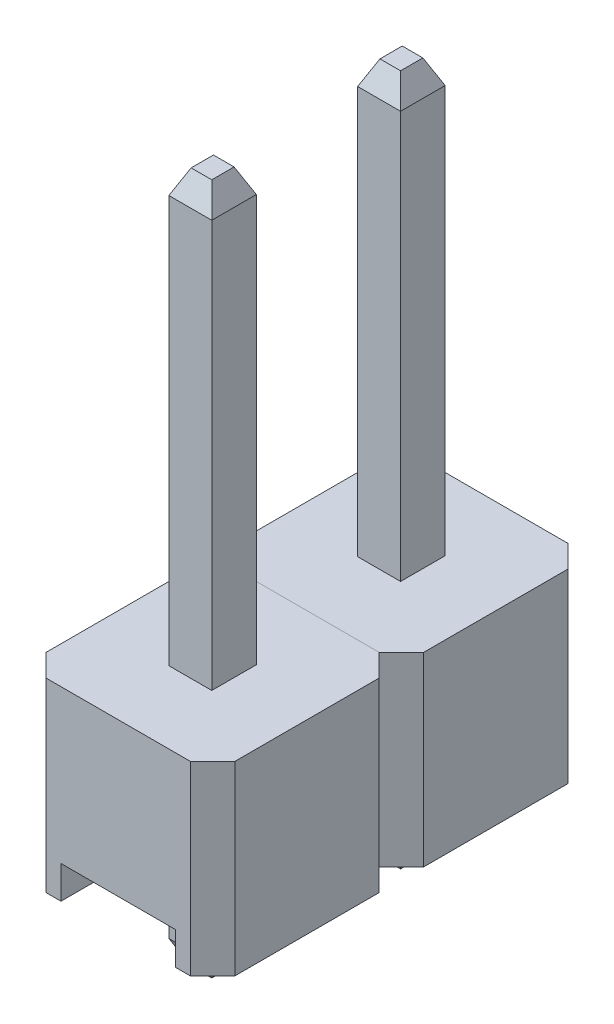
from build123d import *

# Parameters (mm, degrees)
CUERPO_PL_STICO_DEPTH = 2.5
CROQUIS2_W            = 1.54
CROQUIS2_H            = 2.54
RANURA_DEPTH          = 0.44
PIN_DEPTH             = 5.8
PIN_DEPTH_BACK        = 3.5
CROQUIS3_W            = 0.57750613
CROQUIS3_H            = 0.6
CHAFL_N1_SIZE         = 0.15
CHAFL_N1_SIZE2        = 0.321676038
CHAFL_N2_SIZE         = 0.15
CHAFL_N2_SIZE2        = 0.321676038
MATRIZ_COUNT          = 2
MATRIZ_PITCH          = 2.54


with BuildPart() as part:
    # Croquis1 → Cuerpo Pl_stico (new body)
    with BuildSketch(Plane(origin=(0, 0, 0), x_dir=(1, 0, 0), z_dir=(0, 1, 0))):
        Polygon((0.3, 0), (2.24, 0), (2.54, 0.3), (2.54, 2.24), (2.24, 2.54), (0.3, 2.54), (0, 2.24), (0, 0.3), align=None)
    extrude(amount=CUERPO_PL_STICO_DEPTH)

    # Croquis2 → Ranura (cut)
    with BuildSketch(Plane.XZ):
        with Locations((1.27, -1.27)):
            Rectangle(CROQUIS2_W, CROQUIS2_H)
    extrude(amount=-RANURA_DEPTH, mode=Mode.SUBTRACT)

    # Croquis3 → Pin (add, two sides: drawn at the far end of the back side and taken through both)
    with BuildSketch(Plane(origin=(0, 2.5, 0), x_dir=(1, 0, 0), z_dir=(0, 1, 0)).offset(-PIN_DEPTH_BACK)):
        with Locations((1.27, 1.27)):
            Rectangle(CROQUIS3_W, CROQUIS3_H)
    extrude(amount=PIN_DEPTH + PIN_DEPTH_BACK)

    # Chafl_n1
    chafl_n1_edges = [part.edges().sort_by_distance(p)[0] for p in [
        (0.981246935, 8.3, -1.27),
        (1.27, 8.3, -0.97),
        (1.558753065, 8.3, -1.27),
        (1.27, 8.3, -1.57),
    ]]
    chafl_n1_side = [part.faces().sort_by_distance(p)[0] for p in [
        (1.27, 8.3, -1.27),
    ]]
    chamfer(chafl_n1_edges, length=CHAFL_N1_SIZE, length2=CHAFL_N1_SIZE2, reference=chafl_n1_side[0])

    # Chafl_n2
    chafl_n2_edges = [part.edges().sort_by_distance(p)[0] for p in [
        (0.981246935, -1, -1.27),
        (1.27, -1, -1.57),
        (1.558753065, -1, -1.27),
        (1.27, -1, -0.97),
    ]]
    chafl_n2_side = [part.faces().sort_by_distance(p)[0] for p in [
        (1.27, -1, -1.27),
    ]]
    chamfer(chafl_n2_edges, length=CHAFL_N2_SIZE, length2=CHAFL_N2_SIZE2, reference=chafl_n2_side[0])


with BuildPart() as matriz_1:
    # Matriz: pattern copy
    add(part.part.moved(Location(Vector(0, 0, 1) * (1 * MATRIZ_PITCH))))


solid = Compound([part.part, matriz_1.part])
